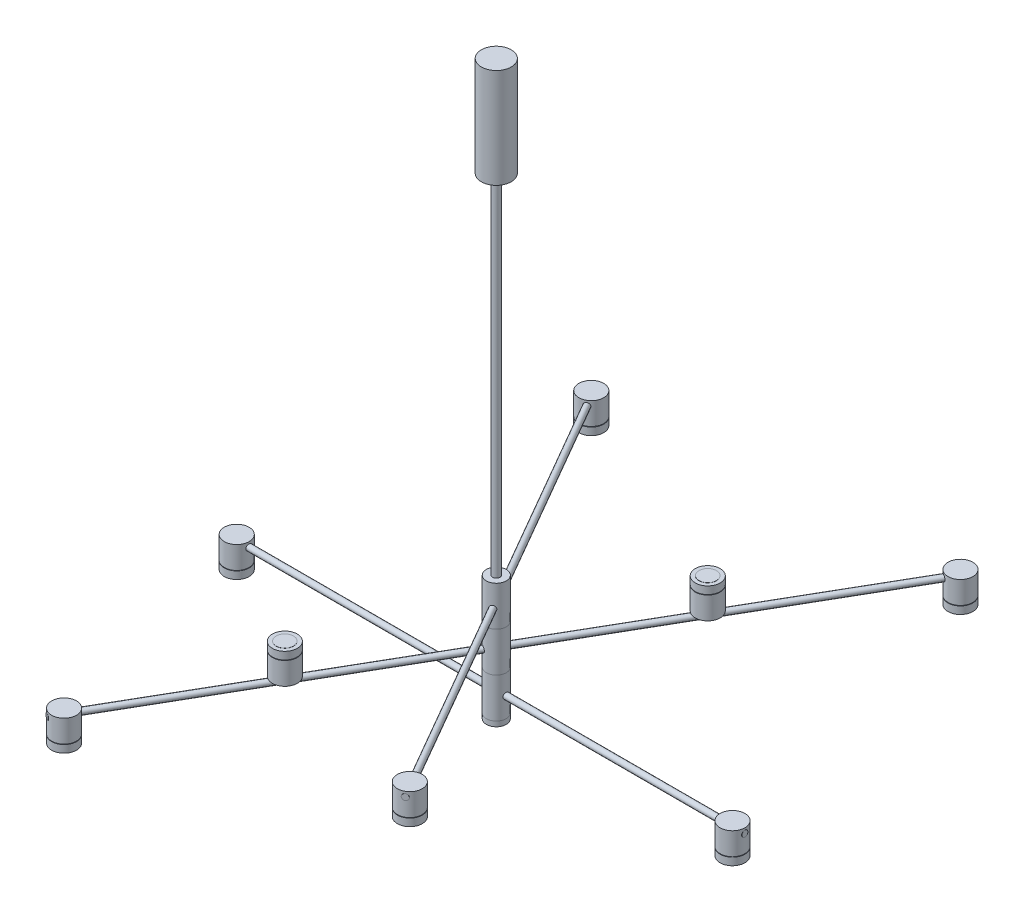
from build123d import *

# Parameters (mm, degrees)
CROQUIS1_R                     = 20
SALIENTE_EXTRUIR1_DEPTH        = 80
CROQUIS2_R                     = 20
SALIENTE_EXTRUIR2_DEPTH        = 80
CROQUIS3_R                     = 20
SALIENTE_EXTRUIR3_DEPTH        = 80
BARRER1_PROFILE_R              = 6
SALIENTE_EXTRUIR4_DEPTH        = 35
SALIENTE_EXTRUIR4_DEPTH_BACK   = 10
CROQUIS17_R                    = 25
SALIENTE_EXTRUIR4_2_DEPTH      = 35
SALIENTE_EXTRUIR4_2_DEPTH_BACK = 10
BARRER2_PROFILE_R              = 6
BARRER3_PROFILE_R              = 6
SALIENTE_EXTRUIR5_DEPTH        = 35
SALIENTE_EXTRUIR5_DEPTH_BACK   = 10
CROQUIS44_R                    = 25
SALIENTE_EXTRUIR5_2_DEPTH      = 35
SALIENTE_EXTRUIR5_2_DEPTH_BACK = 10
SALIENTE_EXTRUIR6_DEPTH        = 35
SALIENTE_EXTRUIR6_DEPTH_BACK   = 10
CROQUIS45_R                    = 25
SALIENTE_EXTRUIR6_2_DEPTH      = 35
SALIENTE_EXTRUIR6_2_DEPTH_BACK = 10
CROQUIS46_R                    = 25
SALIENTE_EXTRUIR7_DEPTH        = 45
SALIENTE_EXTRUIR7_2_DEPTH      = 45
CROQUIS53_R                    = 7.5
SALIENTE_EXTRUIR8_DEPTH        = 700
CROQUIS54_R                    = 30
SALIENTE_EXTRUIR9_DEPTH        = 200
CROQUIS56_R                    = 23
SALIENTE_EXTRUIR10_DEPTH       = 1
CROQUIS56_R_2                  = 24
SALIENTE_EXTRUIR10_2_DEPTH     = 1
CROQUIS57_R                    = 25
SALIENTE_EXTRUIR11_DEPTH       = 15
SALIENTE_EXTRUIR11_2_DEPTH     = 15
CROQUIS58_R                    = 24
SALIENTE_EXTRUIR12_DEPTH       = 1
SALIENTE_EXTRUIR12_2_DEPTH     = 1
CROQUIS59_R                    = 25
SALIENTE_EXTRUIR13_DEPTH       = 15
SALIENTE_EXTRUIR13_2_DEPTH     = 15
CROQUIS64_R                    = 24
SALIENTE_EXTRUIR14_DEPTH       = 1
SALIENTE_EXTRUIR14_2_DEPTH     = 1
CROQUIS65_R                    = 25
SALIENTE_EXTRUIR15_DEPTH       = 15
SALIENTE_EXTRUIR15_2_DEPTH     = 15
CROQUIS66_R                    = 24
SALIENTE_EXTRUIR16_DEPTH       = 1
SALIENTE_EXTRUIR16_2_DEPTH     = 1
CROQUIS67_R                    = 25
SALIENTE_EXTRUIR17_DEPTH       = 15
SALIENTE_EXTRUIR17_2_DEPTH     = 15
CROQUIS68_R                    = 17.5
SALIENTE_EXTRUIR18_DEPTH       = 0.25
SALIENTE_EXTRUIR18_2_DEPTH     = 0.25
CROQUIS69_R                    = 17.5
SALIENTE_EXTRUIR19_DEPTH       = 0.25
SALIENTE_EXTRUIR19_2_DEPTH     = 0.25
CROQUIS70_R                    = 17.5
SALIENTE_EXTRUIR20_DEPTH       = 0.25
SALIENTE_EXTRUIR20_2_DEPTH     = 0.25
CROQUIS71_R                    = 17.5
SALIENTE_EXTRUIR21_DEPTH       = 0.25
SALIENTE_EXTRUIR21_2_DEPTH     = 0.25
CROQUIS84_R                    = 20
SALIENTE_EXTRUIR22_DEPTH       = 10


with BuildPart() as part:
    # Croquis1 → Saliente-Extruir1 (new body)
    with BuildSketch(Plane(origin=(0, 0, 0), x_dir=(1, 0, 0), z_dir=(0, 1, 0))):
        with Locations(Location((0, 0, 0), (0, 0, 270))):
            Circle(CROQUIS1_R)
    extrude(amount=SALIENTE_EXTRUIR1_DEPTH)

    # Barrer1: sweep along a path in Croquis4
    with BuildLine(Plane.XY) as barrer1_path:
        Line((-500, 40), (500, 40))
    # Barrer1 profile (on start of the path) → Barrer1 (sweep)
    with BuildSketch(Plane(origin=(-500, 40, 0), x_dir=(0, 1, 0), z_dir=(1, 0, 0))):
        Circle(BARRER1_PROFILE_R)
    sweep(path=barrer1_path.line)


with BuildPart() as body_2:
    # Croquis2 → Saliente-Extruir2 (new body)
    with BuildSketch(Plane(origin=(0, 80, 0), x_dir=(1, 0, 0), z_dir=(0, 1, 0))):
        with Locations(Location((0, 0, 0), (0, 0, 270))):
            Circle(CROQUIS2_R)
    extrude(amount=SALIENTE_EXTRUIR2_DEPTH)


with BuildPart() as body_3:
    # Croquis3 → Saliente-Extruir3 (new body)
    with BuildSketch(Plane(origin=(0, 160, 0), x_dir=(1, 0, 0), z_dir=(0, 1, 0))):
        with Locations(Location((0, 0, 0), (0, 0, 270))):
            Circle(CROQUIS3_R)
    extrude(amount=SALIENTE_EXTRUIR3_DEPTH)

    # Barrer3: sweep along a path in Croquis31
    with BuildLine(Plane(origin=(0, 195, 0), x_dir=(-1, 0, 0), z_dir=(0, -1, 0))) as barrer3_path:
        Line((250, 433.012701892), (-250, -433.012701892))
    # Barrer3 profile (on start of the path) → Barrer3 (sweep)
    with BuildSketch(Plane(origin=(-250, 195, -433.012701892), x_dir=(0.8660254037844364, 0, -0.5000000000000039), z_dir=(0.5000000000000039, 0, 0.8660254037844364))):
        Circle(BARRER3_PROFILE_R)
    sweep(path=barrer3_path.line)


with BuildPart() as body_4:
    # Croquis17 → Saliente-Extruir4 (new, two sides: drawn at the far end of the back side and taken through both)
    with BuildSketch(Plane(origin=(0, 40, 0), x_dir=(-1, 0, 0), z_dir=(0, -1, 0)).offset(-SALIENTE_EXTRUIR4_DEPTH_BACK)):
        with Locations(Location((522, 0, 0), (0, 0, 90))):
            Circle(CROQUIS17_R)
    extrude(amount=SALIENTE_EXTRUIR4_DEPTH + SALIENTE_EXTRUIR4_DEPTH_BACK)


with BuildPart() as body_5:
    # Croquis17 → Saliente-Extruir4 2 (new, two sides: drawn at the far end of the back side and taken through both)
    with BuildSketch(Plane(origin=(0, 40, 0), x_dir=(-1, 0, 0), z_dir=(0, -1, 0)).offset(-SALIENTE_EXTRUIR4_2_DEPTH_BACK)):
        with Locations(Location((-475, 0, 0), (0, 0, 90))):
            Circle(CROQUIS17_R)
    extrude(amount=SALIENTE_EXTRUIR4_2_DEPTH + SALIENTE_EXTRUIR4_2_DEPTH_BACK)


with BuildPart() as body_6:
    # Barrer2: sweep along a path in Croquis18
    with BuildLine(Plane(origin=(0, 115, 0), x_dir=(-1, 0, 0), z_dir=(0, -1, 0))) as barrer2_path:
        Line((330.638371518, -572.682458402), (-330.638371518, 572.682458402))
    # Barrer2 profile (on start of the path) → Barrer2 (sweep)
    with BuildSketch(Plane(origin=(-330.638371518, 115, 572.682458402), x_dir=(-0.8660254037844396, 0, -0.4999999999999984), z_dir=(0.4999999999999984, 0, -0.8660254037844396))):
        Circle(BARRER2_PROFILE_R)
    sweep(path=barrer2_path.line)


with BuildPart() as body_7:
    # Croquis44 → Saliente-Extruir5 (new, two sides: drawn at the far end of the back side and taken through both)
    with BuildSketch(Plane(origin=(0, 115, 0), x_dir=(-1, 0, 0), z_dir=(0, -1, 0)).offset(-SALIENTE_EXTRUIR5_DEPTH_BACK)):
        with Locations(Location((-341.638371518, 591.735017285, 0), (0, 0, 90))):
            Circle(CROQUIS44_R)
    extrude(amount=SALIENTE_EXTRUIR5_DEPTH + SALIENTE_EXTRUIR5_DEPTH_BACK)


with BuildPart() as body_8:
    # Croquis44 → Saliente-Extruir5 2 (new, two sides: drawn at the far end of the back side and taken through both)
    with BuildSketch(Plane(origin=(0, 115, 0), x_dir=(-1, 0, 0), z_dir=(0, -1, 0)).offset(-SALIENTE_EXTRUIR5_2_DEPTH_BACK)):
        with Locations(Location((318.138371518, -551.031823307, 0), (0, 0, 90))):
            Circle(CROQUIS44_R)
    extrude(amount=SALIENTE_EXTRUIR5_2_DEPTH + SALIENTE_EXTRUIR5_2_DEPTH_BACK)


with BuildPart() as body_9:
    # Croquis45 → Saliente-Extruir6 (new, two sides: drawn at the far end of the back side and taken through both)
    with BuildSketch(Plane(origin=(0, 195, 0), x_dir=(-1, 0, 0), z_dir=(0, -1, 0)).offset(-SALIENTE_EXTRUIR6_DEPTH_BACK)):
        with Locations(Location((261, 452.065260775, 0), (0, 0, 90))):
            Circle(CROQUIS45_R)
    extrude(amount=SALIENTE_EXTRUIR6_DEPTH + SALIENTE_EXTRUIR6_DEPTH_BACK)


with BuildPart() as body_10:
    # Croquis45 → Saliente-Extruir6 2 (new, two sides: drawn at the far end of the back side and taken through both)
    with BuildSketch(Plane(origin=(0, 195, 0), x_dir=(-1, 0, 0), z_dir=(0, -1, 0)).offset(-SALIENTE_EXTRUIR6_2_DEPTH_BACK)):
        with Locations(Location((-237.5, -411.362066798, 0), (0, 0, 90))):
            Circle(CROQUIS45_R)
    extrude(amount=SALIENTE_EXTRUIR6_2_DEPTH + SALIENTE_EXTRUIR6_2_DEPTH_BACK)


with BuildPart() as body_11:
    # Croquis46 → Saliente-Extruir7 (new body)
    with BuildSketch(Plane(origin=(0, 121, 0), x_dir=(-1, 0, 0), z_dir=(0, -1, 0))):
        with Locations(Location((-155.638371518, 269.573567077, 0), (0, 0, 90))):
            Circle(CROQUIS46_R)
    extrude(amount=-SALIENTE_EXTRUIR7_DEPTH)


with BuildPart() as body_12:
    # Croquis46 → Saliente-Extruir7 2 (new body)
    with BuildSketch(Plane(origin=(0, 121, 0), x_dir=(-1, 0, 0), z_dir=(0, -1, 0))):
        with Locations(Location((155.638371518, -269.573567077, 0), (0, 0, 90))):
            Circle(CROQUIS46_R)
    extrude(amount=-SALIENTE_EXTRUIR7_2_DEPTH)


with BuildPart() as body_13:
    # Croquis53 → Saliente-Extruir8 (new body)
    with BuildSketch(Plane(origin=(0, 240, 0), x_dir=(1, 0, 0), z_dir=(0, 1, 0))):
        with Locations(Location((0, 0, 0), (0, 0, 270))):
            Circle(CROQUIS53_R)
    extrude(amount=SALIENTE_EXTRUIR8_DEPTH)

    # Croquis54 → Saliente-Extruir9 (add)
    with BuildSketch(Plane(origin=(0, 940, 0), x_dir=(1, 0, 0), z_dir=(0, 1, 0))):
        with Locations(Location((0, 0, 0), (0, 0, 270))):
            Circle(CROQUIS54_R)
    extrude(amount=SALIENTE_EXTRUIR9_DEPTH)


with BuildPart() as body_14:
    # Croquis56 → Saliente-Extruir10 (new body)
    with BuildSketch(Plane.XZ.offset(-160)):
        with Locations(Location((-261, -452.065260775, 0), (0, 0, 270))):
            Circle(CROQUIS56_R)
    extrude(amount=SALIENTE_EXTRUIR10_DEPTH)


with BuildPart() as body_15:
    # Croquis56 → Saliente-Extruir10 2 (new body)
    with BuildSketch(Plane.XZ.offset(-160)):
        with Locations(Location((237.5, 411.362066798, 0), (0, 0, 270))):
            Circle(CROQUIS56_R_2)
    extrude(amount=SALIENTE_EXTRUIR10_2_DEPTH)


with BuildPart() as body_16:
    # Croquis57 → Saliente-Extruir11 (new body)
    with BuildSketch(Plane.XZ.offset(-159)):
        with Locations(Location((-261, -452.065260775, 0), (0, 0, 270))):
            Circle(CROQUIS57_R)
    extrude(amount=SALIENTE_EXTRUIR11_DEPTH)


with BuildPart() as body_17:
    # Croquis57 → Saliente-Extruir11 2 (new body)
    with BuildSketch(Plane.XZ.offset(-159)):
        with Locations(Location((237.5, 411.362066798, 0), (0, 0, 270))):
            Circle(CROQUIS57_R)
    extrude(amount=SALIENTE_EXTRUIR11_2_DEPTH)


with BuildPart() as body_18:
    # Croquis58 → Saliente-Extruir12 (new body)
    with BuildSketch(Plane.XZ.offset(-5)):
        with Locations(Location((475, 0, 0), (0, 0, 270))):
            Circle(CROQUIS58_R)
    extrude(amount=SALIENTE_EXTRUIR12_DEPTH)


with BuildPart() as body_19:
    # Croquis58 → Saliente-Extruir12 2 (new body)
    with BuildSketch(Plane.XZ.offset(-5)):
        with Locations(Location((-522, 0, 0), (0, 0, 270))):
            Circle(CROQUIS58_R)
    extrude(amount=SALIENTE_EXTRUIR12_2_DEPTH)


with BuildPart() as body_20:
    # Croquis59 → Saliente-Extruir13 (new body)
    with BuildSketch(Plane.XZ.offset(-4)):
        with Locations(Location((475, 0, 0), (0, 0, 270))):
            Circle(CROQUIS59_R)
    extrude(amount=SALIENTE_EXTRUIR13_DEPTH)


with BuildPart() as body_21:
    # Croquis59 → Saliente-Extruir13 2 (new body)
    with BuildSketch(Plane.XZ.offset(-4)):
        with Locations(Location((-522, 0, 0), (0, 0, 270))):
            Circle(CROQUIS59_R)
    extrude(amount=SALIENTE_EXTRUIR13_2_DEPTH)


with BuildPart() as body_22:
    # Croquis64 → Saliente-Extruir14 (new body)
    with BuildSketch(Plane.XZ.offset(-80)):
        with Locations(Location((341.638371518, -591.735017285, 0), (0, 0, 270))):
            Circle(CROQUIS64_R)
    extrude(amount=SALIENTE_EXTRUIR14_DEPTH)


with BuildPart() as body_23:
    # Croquis64 → Saliente-Extruir14 2 (new body)
    with BuildSketch(Plane.XZ.offset(-80)):
        with Locations(Location((-318.138371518, 551.031823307, 0), (0, 0, 270))):
            Circle(CROQUIS64_R)
    extrude(amount=SALIENTE_EXTRUIR14_2_DEPTH)


with BuildPart() as body_24:
    # Croquis65 → Saliente-Extruir15 (new body)
    with BuildSketch(Plane.XZ.offset(-79)):
        with Locations(Location((-318.138371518, 551.031823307, 0), (0, 0, 270))):
            Circle(CROQUIS65_R)
    extrude(amount=SALIENTE_EXTRUIR15_DEPTH)


with BuildPart() as body_25:
    # Croquis65 → Saliente-Extruir15 2 (new body)
    with BuildSketch(Plane.XZ.offset(-79)):
        with Locations(Location((341.638371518, -591.735017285, 0), (0, 0, 270))):
            Circle(CROQUIS65_R)
    extrude(amount=SALIENTE_EXTRUIR15_2_DEPTH)


with BuildPart() as body_26:
    # Croquis66 → Saliente-Extruir16 (new body)
    with BuildSketch(Plane(origin=(0, 166, 0), x_dir=(1, 0, 0), z_dir=(0, 1, 0))):
        with Locations(Location((-155.638371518, -269.573567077, 0), (0, 0, 270))):
            Circle(CROQUIS66_R)
    extrude(amount=SALIENTE_EXTRUIR16_DEPTH)


with BuildPart() as body_27:
    # Croquis66 → Saliente-Extruir16 2 (new body)
    with BuildSketch(Plane(origin=(0, 166, 0), x_dir=(1, 0, 0), z_dir=(0, 1, 0))):
        with Locations(Location((155.638371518, 269.573567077, 0), (0, 0, 270))):
            Circle(CROQUIS66_R)
    extrude(amount=SALIENTE_EXTRUIR16_2_DEPTH)


with BuildPart() as body_28:
    # Croquis67 → Saliente-Extruir17 (new body)
    with BuildSketch(Plane(origin=(0, 167, 0), x_dir=(1, 0, 0), z_dir=(0, 1, 0))):
        with Locations(Location((155.638371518, 269.573567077, 0), (0, 0, 270))):
            Circle(CROQUIS67_R)
    extrude(amount=SALIENTE_EXTRUIR17_DEPTH)


with BuildPart() as body_29:
    # Croquis67 → Saliente-Extruir17 2 (new body)
    with BuildSketch(Plane(origin=(0, 167, 0), x_dir=(1, 0, 0), z_dir=(0, 1, 0))):
        with Locations(Location((-155.638371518, -269.573567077, 0), (0, 0, 270))):
            Circle(CROQUIS67_R)
    extrude(amount=SALIENTE_EXTRUIR17_2_DEPTH)


with BuildPart() as body_30:
    # Croquis68 → Saliente-Extruir18 (new body)
    with BuildSketch(Plane.XZ.offset(-144)):
        with Locations(Location((-261, -452.065260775, 0), (0, 0, 270))):
            Circle(CROQUIS68_R)
    extrude(amount=SALIENTE_EXTRUIR18_DEPTH)


with BuildPart() as body_31:
    # Croquis68 → Saliente-Extruir18 2 (new body)
    with BuildSketch(Plane.XZ.offset(-144)):
        with Locations(Location((237.5, 411.362066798, 0), (0, 0, 270))):
            Circle(CROQUIS68_R)
    extrude(amount=SALIENTE_EXTRUIR18_2_DEPTH)


with BuildPart() as body_32:
    # Croquis69 → Saliente-Extruir19 (new body)
    with BuildSketch(Plane.XZ.offset(11)):
        with Locations(Location((475, 0, 0), (0, 0, 270))):
            Circle(CROQUIS69_R)
    extrude(amount=SALIENTE_EXTRUIR19_DEPTH)


with BuildPart() as body_33:
    # Croquis69 → Saliente-Extruir19 2 (new body)
    with BuildSketch(Plane.XZ.offset(11)):
        with Locations(Location((-522, 0, 0), (0, 0, 270))):
            Circle(CROQUIS69_R)
    extrude(amount=SALIENTE_EXTRUIR19_2_DEPTH)


with BuildPart() as body_34:
    # Croquis70 → Saliente-Extruir20 (new body)
    with BuildSketch(Plane.XZ.offset(-64)):
        with Locations(Location((-318.138371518, 551.031823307, 0), (0, 0, 270))):
            Circle(CROQUIS70_R)
    extrude(amount=SALIENTE_EXTRUIR20_DEPTH)


with BuildPart() as body_35:
    # Croquis70 → Saliente-Extruir20 2 (new body)
    with BuildSketch(Plane.XZ.offset(-64)):
        with Locations(Location((341.638371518, -591.735017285, 0), (0, 0, 270))):
            Circle(CROQUIS70_R)
    extrude(amount=SALIENTE_EXTRUIR20_2_DEPTH)


with BuildPart() as body_36:
    # Croquis71 → Saliente-Extruir21 (new body)
    with BuildSketch(Plane(origin=(0, 182, 0), x_dir=(1, 0, 0), z_dir=(0, 1, 0))):
        with Locations(Location((155.638371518, 269.573567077, 0), (0, 0, 270))):
            Circle(CROQUIS71_R)
    extrude(amount=SALIENTE_EXTRUIR21_DEPTH)


with BuildPart() as body_37:
    # Croquis71 → Saliente-Extruir21 2 (new body)
    with BuildSketch(Plane(origin=(0, 182, 0), x_dir=(1, 0, 0), z_dir=(0, 1, 0))):
        with Locations(Location((-155.638371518, -269.573567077, 0), (0, 0, 270))):
            Circle(CROQUIS71_R)
    extrude(amount=SALIENTE_EXTRUIR21_2_DEPTH)


with BuildPart() as body_38:
    # Croquis84 → Saliente-Extruir22 (new body)
    with BuildSketch(Plane.XZ):
        with Locations(Location((0, 0, 0), (0, 0, 270))):
            Circle(CROQUIS84_R)
    extrude(amount=SALIENTE_EXTRUIR22_DEPTH)


solid = Compound([part.part, body_2.part, body_3.part, body_4.part, body_5.part, body_6.part, body_7.part, body_8.part, body_9.part, body_10.part, body_11.part, body_12.part, body_13.part, body_14.part, body_15.part, body_16.part, body_17.part, body_18.part, body_19.part, body_20.part, body_21.part, body_22.part, body_23.part, body_24.part, body_25.part, body_26.part, body_27.part, body_28.part, body_29.part, body_30.part, body_31.part, body_32.part, body_33.part, body_34.part, body_35.part, body_36.part, body_37.part, body_38.part])
